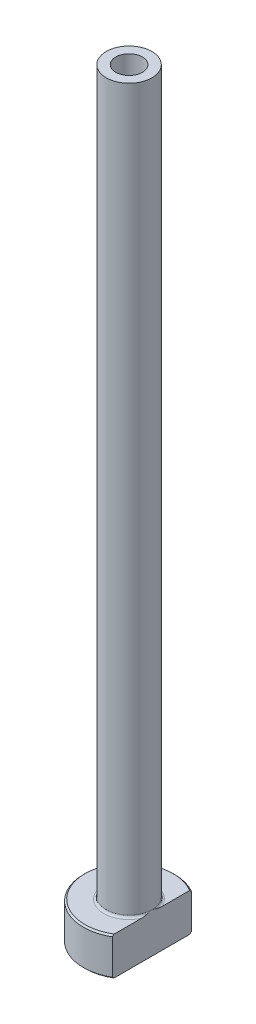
from build123d import *

# Parameters (mm, degrees)
FILLET1_R          = 0.3
CHAMFER1_SIZE      = 0.2
CUT_EXTRUDE1_DEPTH = 101.359354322
CHAMFER2_SIZE      = 0.5


with BuildPart() as part:
    # Sketch1 → Revolve1 (revolve)
    with BuildSketch(Plane.XY, mode=Mode.PRIVATE) as revolve1_sk:
        Polygon((-1.75, 100), (-3, 100), (-3, 5), (-6, 5), (-6, 0), (-2, 0), (-2, 43), (-1.75, 55), align=None)
    revolve(revolve1_sk.sketch.rotate(Axis((0, 92.187680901, 0), (0, -1, 0)), 270), axis=Axis((0, 92.187680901, 0), (0, -1, 0)))

    # Fillet1
    fillet1_edges = [part.edges().sort_by_distance(p)[0] for p in [
        (0, 5, -3),
    ]]
    fillet(fillet1_edges, radius=FILLET1_R)

    # Chamfer1
    chamfer1_edges = [part.edges().sort_by_distance(p)[0] for p in [
        (0, 0, -6),
        (0, 5, -6),
    ]]
    chamfer(chamfer1_edges, length=CHAMFER1_SIZE)

    # Sketch2 → Cut-Extrude1 (cut, through all)
    with BuildSketch(Plane.XZ):
        with BuildLine():
            Line((3, 5.196152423), (3, -5.196152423))
            ThreePointArc((3, -5.196152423), (6, 0), (3, 5.196152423))
        make_face()
    extrude(amount=-CUT_EXTRUDE1_DEPTH, mode=Mode.SUBTRACT)

    # Chamfer2
    chamfer2_edges = [part.edges().sort_by_distance(p)[0] for p in [
        (0, 0, -2),
    ]]
    chamfer(chamfer2_edges, length=CHAMFER2_SIZE)


solid = part.part
